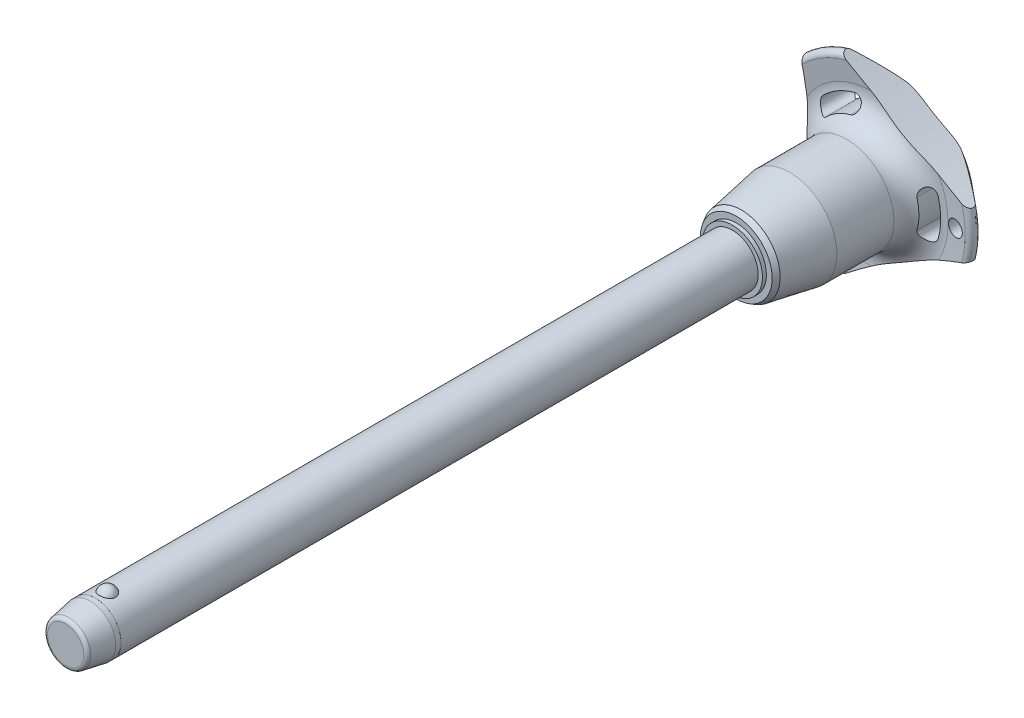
from build123d import *

# Parameters (mm, degrees)
SKETCH1_R           = 5
BOSS_EXTRUDE1_DEPTH = 120
SKETCH2_R           = 4.25
BOSS_EXTRUDE2_DEPTH = 33.3
BOSS_EXTRUDE3_START = 9.6
SKETCH1_2_R         = 5
BOSS_EXTRUDE3_DEPTH = 9.6
CHAMFER1_SIZE       = 4.8
CHAMFER1_SIZE2      = 0.846369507
FILLET1_R           = 0.75
SKETCH6_R           = 102.8
CUT_EXTRUDE1_DEPTH  = 156.789328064
CIRPATTERN1_COUNT   = 3
SKETCH7_R           = 1.5
CUT_EXTRUDE2_DEPTH  = 156.685475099
SKETCH8_R           = 5
SKETCH8_R_2         = 4.99
CUT_EXTRUDE3_DEPTH  = 5.76


with BuildPart() as part:
    # Sketch1 → Boss-Extrude1 (new body)
    with BuildSketch(Plane.XY):
        Circle(SKETCH1_R)
    extrude(amount=-BOSS_EXTRUDE1_DEPTH)

    # Sketch2 → Boss-Extrude2 (add)
    with BuildSketch(Plane(origin=(0, 0, -120), x_dir=(-1, 0, 0), z_dir=(0, 0, -1))):
        Circle(SKETCH2_R)
    extrude(amount=BOSS_EXTRUDE2_DEPTH)

    # Sketch3 → Revolve1 (revolve)
    with BuildSketch(Plane(origin=(0, 0, 0), x_dir=(0, 0, -1), z_dir=(1, 0, 0))):
        with BuildLine():
            Line((-1.516575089, 6), (-1.516575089, 2.7))
            ThreePointArc((-1.516575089, 2.7), (0.133424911, 4.35), (-1.516575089, 6))
        make_face()
        with BuildLine():
            Line((-1.516575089, -2.7), (-1.516575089, -6))
            ThreePointArc((-1.516575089, -6), (0.133424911, -4.35), (-1.516575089, -2.7))
        make_face()
    revolve(axis=Axis((0, -2.7, 1.516575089), (0, 1, 0)))

    # Sketch1_2 → Boss-Extrude3 (add)
    with BuildSketch(Plane.XY.offset(BOSS_EXTRUDE3_START)):
        Circle(SKETCH1_2_R)
    extrude(amount=-BOSS_EXTRUDE3_DEPTH)

    # Chamfer1
    chamfer1_edges = [part.edges().sort_by_distance(p)[0] for p in [
        (-5, 0, 9.6),
    ]]
    chamfer1_side = [part.faces().sort_by_distance(p)[0] for p in [
        (-5, 0, -55.2),
    ]]
    chamfer(chamfer1_edges, length=CHAMFER1_SIZE, length2=CHAMFER1_SIZE2, reference=chamfer1_side[0])

    # Fillet1
    fillet1_edges = [part.edges().sort_by_distance(p)[0] for p in [
        (-4.153630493, 0, 9.6),
        (4.25, 0, -153.3),
    ]]
    fillet(fillet1_edges, radius=FILLET1_R)

    # Sketch4 → Revolve2 (revolve)
    with BuildSketch(Plane(origin=(0, 0, 0), x_dir=(0, 0, -1), z_dir=(1, 0, 0)), mode=Mode.PRIVATE) as revolve2_sk:
        Polygon((120, 0), (120, 5.848880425), (120.75, 5.848880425), (120.75, 6.981619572), (121.730980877, 7.547989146), (131.1, 9.2), (142.2, 9.2), (142.2, 0), align=None)
    revolve(revolve2_sk.sketch.rotate(Axis((0, 0, -142.2), (0, 0, 1)), 90), axis=Axis((0, 0, -142.2), (0, 0, 1)))

    # Sketch5 → Revolve3 (revolve)
    with BuildSketch(Plane(origin=(0, 0, 0), x_dir=(0, 0, -1), z_dir=(1, 0, 0)), mode=Mode.PRIVATE) as revolve3_sk:
        with BuildLine():
            Line((147.169704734, 14.749576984), (146.756059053, 18.490084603))
            ThreePointArc((146.756059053, 18.490084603), (147.35677658, 19.519442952), (148.516044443, 19.24278761))
            Line((148.516044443, 19.24278761), (152.835691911, 14.094832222))
            ThreePointArc((152.835691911, 14.094832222), (153.3, 12.689260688), (152.67067517, 11.349423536))
            ThreePointArc((152.67067517, 11.349423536), (149.033110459, 6.185112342), (147.75, 0))
            Line((147.75, 0), (142.2, 0))
            Line((142.2, 0), (142.2, 9.2))
            ThreePointArc((142.2, 9.2), (145.924774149, 10.864425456), (147.169704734, 14.749576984))
        make_face()
    revolve(revolve3_sk.sketch.rotate(Axis((0, 0, -147.75), (0, 0, 1)), 90), axis=Axis((0, 0, -147.75), (0, 0, 1)))

    # Sketch6 → Cut-Extrude1 (cut, through all)
    with BuildSketch(Plane.XY):
        with Locations((-115.2, 0)):
            Circle(SKETCH6_R)
        with BuildLine():
            ThreePointArc((12.885043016, -3.538869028), (13.362182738, 0), (12.885043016, 3.538869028))
            ThreePointArc((12.885043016, 3.538869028), (11.179749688, 4.509281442), (10.209337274, 2.803988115))
            ThreePointArc((10.209337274, 2.803988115), (10.587394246, 0), (10.209337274, -2.803988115))
            ThreePointArc((10.209337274, -2.803988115), (11.179749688, -4.509281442), (12.885043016, -3.538869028))
        make_face()
    cut_extrude1 = extrude(amount=-CUT_EXTRUDE1_DEPTH, mode=Mode.SUBTRACT)

    # CirPattern1: Cut-Extrude1 ×3 about axis
    cirpattern1_axis = Axis((0, 0, 0), (0, 0, 1))
    for i in range(1, CIRPATTERN1_COUNT):
        add(cut_extrude1.rotate(cirpattern1_axis, i * 360 / CIRPATTERN1_COUNT), mode=Mode.SUBTRACT)

    # Sketch7 → Cut-Extrude2 (cut, through all)
    with BuildSketch(Plane.XY):
        with Locations(Location((16.362182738, 0, 0), (0, 0, 225.449470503))):
            Circle(SKETCH7_R)
    extrude(amount=-CUT_EXTRUDE2_DEPTH, mode=Mode.SUBTRACT)

    # Sketch8 → Cut-Extrude3 (cut)
    with BuildSketch(Plane.XY.offset(9.6)):
        Circle(SKETCH8_R)
        Circle(SKETCH8_R_2, mode=Mode.SUBTRACT)
    extrude(amount=-CUT_EXTRUDE3_DEPTH, mode=Mode.SUBTRACT)


solid = part.part
